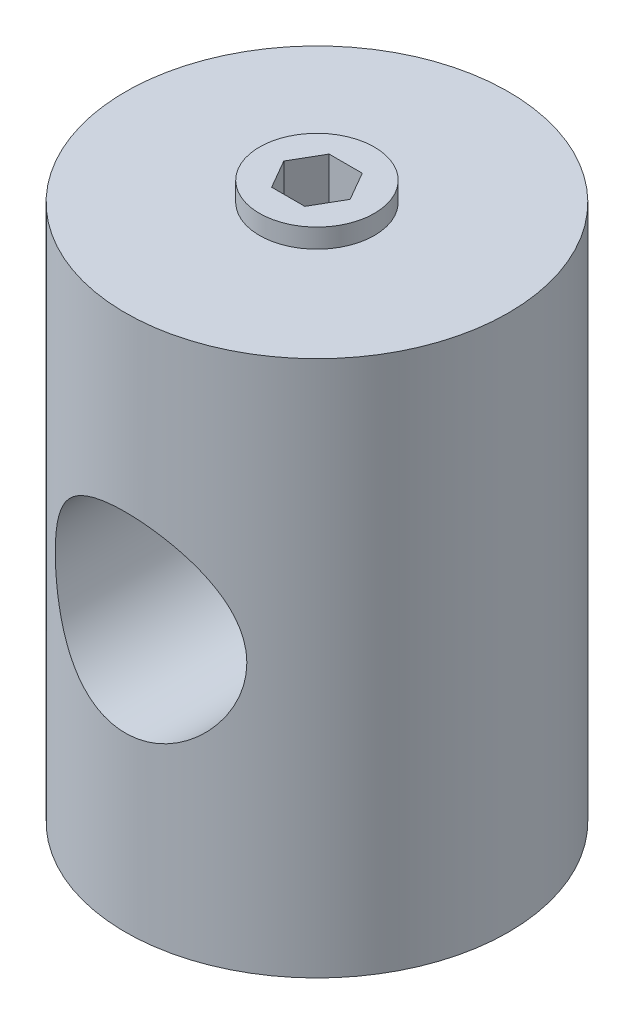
ISO-10303-21;
HEADER;
FILE_DESCRIPTION(('STEP AP214'),'2;1');
FILE_NAME('part.step','',(''),(''),'','','');
FILE_SCHEMA(('AUTOMOTIVE_DESIGN { 1 0 10303 214 1 1 1 1 }'));
ENDSEC;
DATA;
#1=APPLICATION_CONTEXT('core data for automotive mechanical design processes');
#2=APPLICATION_PROTOCOL_DEFINITION('international standard','automotive_design',2000,#1);
#3=PRODUCT_CONTEXT('',#1,'mechanical');
#4=PRODUCT('Part','Part','',(#3));
#5=PRODUCT_RELATED_PRODUCT_CATEGORY('part','',(#4));
#6=PRODUCT_DEFINITION_FORMATION('','',#4);
#7=PRODUCT_DEFINITION_CONTEXT('part definition',#1,'design');
#8=PRODUCT_DEFINITION('design','',#6,#7);
#9=PRODUCT_DEFINITION_SHAPE('','',#8);
#10=(LENGTH_UNIT() NAMED_UNIT(*) SI_UNIT(.MILLI.,.METRE.));
#11=(NAMED_UNIT(*) PLANE_ANGLE_UNIT() SI_UNIT($,.RADIAN.));
#12=(NAMED_UNIT(*) SI_UNIT($,.STERADIAN.) SOLID_ANGLE_UNIT());
#13=UNCERTAINTY_MEASURE_WITH_UNIT(LENGTH_MEASURE(1.E-05),#10,'distance_accuracy_value','');
#14=(GEOMETRIC_REPRESENTATION_CONTEXT(3) GLOBAL_UNCERTAINTY_ASSIGNED_CONTEXT((#13)) GLOBAL_UNIT_ASSIGNED_CONTEXT((#10,
#11,#12)) REPRESENTATION_CONTEXT('',''));
#15=CARTESIAN_POINT('',(0.,0.,0.));
#16=DIRECTION('',(0.,0.,1.));
#17=DIRECTION('',(1.,0.,0.));
#18=AXIS2_PLACEMENT_3D('',#15,#16,#17);
#19=CARTESIAN_POINT('',(-1.29903810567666,6.3,0.75));
#20=DIRECTION('',(0.,1.,0.));
#21=DIRECTION('',(-1.,0.,0.));
#22=AXIS2_PLACEMENT_3D('',#19,#20,#21);
#23=PLANE('',#22);
#24=DIRECTION('',(-0.5,0.,0.866025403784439));
#25=VECTOR('',#24,1.);
#26=CARTESIAN_POINT('',(-0.43301270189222,6.3,-0.75));
#27=LINE('',#26,#25);
#28=CARTESIAN_POINT('',(-0.43301270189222,6.3,-0.75));
#29=VERTEX_POINT('',#28);
#30=CARTESIAN_POINT('',(-0.86602540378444,6.3,0.));
#31=VERTEX_POINT('',#30);
#32=EDGE_CURVE('E169',#29,#31,#27,.T.);
#33=ORIENTED_EDGE('',*,*,#32,.T.);
#34=DIRECTION('',(0.5,0.,0.866025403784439));
#35=VECTOR('',#34,1.);
#36=CARTESIAN_POINT('',(-0.86602540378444,6.3,0.));
#37=LINE('',#36,#35);
#38=CARTESIAN_POINT('',(-0.43301270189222,6.3,0.75));
#39=VERTEX_POINT('',#38);
#40=EDGE_CURVE('E91',#31,#39,#37,.T.);
#41=ORIENTED_EDGE('',*,*,#40,.T.);
#42=DIRECTION('',(1.,0.,0.));
#43=VECTOR('',#42,1.);
#44=CARTESIAN_POINT('',(-0.43301270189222,6.3,0.75));
#45=LINE('',#44,#43);
#46=CARTESIAN_POINT('',(0.433012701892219,6.3,0.75));
#47=VERTEX_POINT('',#46);
#48=EDGE_CURVE('E165',#39,#47,#45,.T.);
#49=ORIENTED_EDGE('',*,*,#48,.T.);
#50=DIRECTION('',(0.5,0.,-0.866025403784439));
#51=VECTOR('',#50,1.);
#52=CARTESIAN_POINT('',(0.433012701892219,6.3,0.75));
#53=LINE('',#52,#51);
#54=CARTESIAN_POINT('',(0.866025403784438,6.3,0.));
#55=VERTEX_POINT('',#54);
#56=EDGE_CURVE('E162',#47,#55,#53,.T.);
#57=ORIENTED_EDGE('',*,*,#56,.T.);
#58=DIRECTION('',(-0.5,0.,-0.866025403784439));
#59=VECTOR('',#58,1.);
#60=CARTESIAN_POINT('',(0.866025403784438,6.3,0.));
#61=LINE('',#60,#59);
#62=CARTESIAN_POINT('',(0.43301270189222,6.3,-0.75));
#63=VERTEX_POINT('',#62);
#64=EDGE_CURVE('E159',#55,#63,#61,.T.);
#65=ORIENTED_EDGE('',*,*,#64,.T.);
#66=DIRECTION('',(-1.,0.,0.));
#67=VECTOR('',#66,1.);
#68=CARTESIAN_POINT('',(0.43301270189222,6.3,-0.75));
#69=LINE('',#68,#67);
#70=EDGE_CURVE('E93',#63,#29,#69,.T.);
#71=ORIENTED_EDGE('',*,*,#70,.T.);
#72=EDGE_LOOP('',(#33,#41,#49,#57,#65,#71));
#73=FACE_BOUND('',#72,.T.);
#74=ADVANCED_FACE('F14',(#73),#23,.T.);
#75=CARTESIAN_POINT('',(-0.43301270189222,6.3,0.75));
#76=DIRECTION('',(0.,0.,1.));
#77=DIRECTION('',(1.,0.,0.));
#78=AXIS2_PLACEMENT_3D('',#75,#76,#77);
#79=PLANE('',#78);
#80=DIRECTION('',(1.,0.,0.));
#81=VECTOR('',#80,1.);
#82=CARTESIAN_POINT('',(-0.43301270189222,7.5,0.75));
#83=LINE('',#82,#81);
#84=CARTESIAN_POINT('',(-0.43301270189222,7.5,0.75));
#85=VERTEX_POINT('',#84);
#86=CARTESIAN_POINT('',(0.433012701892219,7.5,0.75));
#87=VERTEX_POINT('',#86);
#88=EDGE_CURVE('E98',#85,#87,#83,.T.);
#89=ORIENTED_EDGE('',*,*,#88,.T.);
#90=DIRECTION('',(0.,1.,0.));
#91=VECTOR('',#90,1.);
#92=CARTESIAN_POINT('',(0.433012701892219,6.3,0.75));
#93=LINE('',#92,#91);
#94=EDGE_CURVE('E43',#47,#87,#93,.T.);
#95=ORIENTED_EDGE('',*,*,#94,.F.);
#96=ORIENTED_EDGE('',*,*,#48,.F.);
#97=DIRECTION('',(0.,1.,0.));
#98=VECTOR('',#97,1.);
#99=CARTESIAN_POINT('',(-0.43301270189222,6.3,0.75));
#100=LINE('',#99,#98);
#101=EDGE_CURVE('E35',#39,#85,#100,.T.);
#102=ORIENTED_EDGE('',*,*,#101,.T.);
#103=EDGE_LOOP('',(#89,#95,#96,#102));
#104=FACE_BOUND('',#103,.T.);
#105=ADVANCED_FACE('F182',(#104),#79,.F.);
#106=CARTESIAN_POINT('',(0.433012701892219,6.3,0.75));
#107=DIRECTION('',(0.866025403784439,0.,0.5));
#108=DIRECTION('',(0.5,0.,-0.866025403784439));
#109=AXIS2_PLACEMENT_3D('',#106,#107,#108);
#110=PLANE('',#109);
#111=DIRECTION('',(0.5,0.,-0.866025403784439));
#112=VECTOR('',#111,1.);
#113=CARTESIAN_POINT('',(0.433012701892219,7.5,0.75));
#114=LINE('',#113,#112);
#115=CARTESIAN_POINT('',(0.866025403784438,7.5,0.));
#116=VERTEX_POINT('',#115);
#117=EDGE_CURVE('E100',#87,#116,#114,.T.);
#118=ORIENTED_EDGE('',*,*,#117,.T.);
#119=DIRECTION('',(0.,1.,0.));
#120=VECTOR('',#119,1.);
#121=CARTESIAN_POINT('',(0.866025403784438,6.3,0.));
#122=LINE('',#121,#120);
#123=EDGE_CURVE('E152',#55,#116,#122,.T.);
#124=ORIENTED_EDGE('',*,*,#123,.F.);
#125=ORIENTED_EDGE('',*,*,#56,.F.);
#126=ORIENTED_EDGE('',*,*,#94,.T.);
#127=EDGE_LOOP('',(#118,#124,#125,#126));
#128=FACE_BOUND('',#127,.T.);
#129=ADVANCED_FACE('F176',(#128),#110,.F.);
#130=CARTESIAN_POINT('',(0.866025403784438,6.3,0.));
#131=DIRECTION('',(0.866025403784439,0.,-0.5));
#132=DIRECTION('',(-0.5,0.,-0.866025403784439));
#133=AXIS2_PLACEMENT_3D('',#130,#131,#132);
#134=PLANE('',#133);
#135=DIRECTION('',(-0.5,0.,-0.866025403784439));
#136=VECTOR('',#135,1.);
#137=CARTESIAN_POINT('',(0.866025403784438,7.5,0.));
#138=LINE('',#137,#136);
#139=CARTESIAN_POINT('',(0.43301270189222,7.5,-0.75));
#140=VERTEX_POINT('',#139);
#141=EDGE_CURVE('E173',#116,#140,#138,.T.);
#142=ORIENTED_EDGE('',*,*,#141,.T.);
#143=DIRECTION('',(0.,1.,0.));
#144=VECTOR('',#143,1.);
#145=CARTESIAN_POINT('',(0.43301270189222,6.3,-0.75));
#146=LINE('',#145,#144);
#147=EDGE_CURVE('E154',#63,#140,#146,.T.);
#148=ORIENTED_EDGE('',*,*,#147,.F.);
#149=ORIENTED_EDGE('',*,*,#64,.F.);
#150=ORIENTED_EDGE('',*,*,#123,.T.);
#151=EDGE_LOOP('',(#142,#148,#149,#150));
#152=FACE_BOUND('',#151,.T.);
#153=ADVANCED_FACE('F179',(#152),#134,.F.);
#154=CARTESIAN_POINT('',(0.43301270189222,6.3,-0.75));
#155=DIRECTION('',(0.,0.,-1.));
#156=DIRECTION('',(-1.,0.,0.));
#157=AXIS2_PLACEMENT_3D('',#154,#155,#156);
#158=PLANE('',#157);
#159=DIRECTION('',(-1.,0.,0.));
#160=VECTOR('',#159,1.);
#161=CARTESIAN_POINT('',(0.43301270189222,7.5,-0.75));
#162=LINE('',#161,#160);
#163=CARTESIAN_POINT('',(-0.43301270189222,7.5,-0.75));
#164=VERTEX_POINT('',#163);
#165=EDGE_CURVE('E171',#140,#164,#162,.T.);
#166=ORIENTED_EDGE('',*,*,#165,.T.);
#167=DIRECTION('',(0.,1.,0.));
#168=VECTOR('',#167,1.);
#169=CARTESIAN_POINT('',(-0.43301270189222,6.3,-0.75));
#170=LINE('',#169,#168);
#171=EDGE_CURVE('E79',#29,#164,#170,.T.);
#172=ORIENTED_EDGE('',*,*,#171,.F.);
#173=ORIENTED_EDGE('',*,*,#70,.F.);
#174=ORIENTED_EDGE('',*,*,#147,.T.);
#175=EDGE_LOOP('',(#166,#172,#173,#174));
#176=FACE_BOUND('',#175,.T.);
#177=ADVANCED_FACE('F273',(#176),#158,.F.);
#178=CARTESIAN_POINT('',(-0.43301270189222,6.3,-0.75));
#179=DIRECTION('',(-0.866025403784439,0.,-0.5));
#180=DIRECTION('',(-0.5,0.,0.866025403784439));
#181=AXIS2_PLACEMENT_3D('',#178,#179,#180);
#182=PLANE('',#181);
#183=DIRECTION('',(-0.5,0.,0.866025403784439));
#184=VECTOR('',#183,1.);
#185=CARTESIAN_POINT('',(-0.43301270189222,7.5,-0.75));
#186=LINE('',#185,#184);
#187=CARTESIAN_POINT('',(-0.866025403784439,7.5,0.));
#188=VERTEX_POINT('',#187);
#189=EDGE_CURVE('E73',#164,#188,#186,.T.);
#190=ORIENTED_EDGE('',*,*,#189,.T.);
#191=DIRECTION('',(0.,1.,0.));
#192=VECTOR('',#191,1.);
#193=CARTESIAN_POINT('',(-0.86602540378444,6.3,0.));
#194=LINE('',#193,#192);
#195=EDGE_CURVE('E77',#31,#188,#194,.T.);
#196=ORIENTED_EDGE('',*,*,#195,.F.);
#197=ORIENTED_EDGE('',*,*,#32,.F.);
#198=ORIENTED_EDGE('',*,*,#171,.T.);
#199=EDGE_LOOP('',(#190,#196,#197,#198));
#200=FACE_BOUND('',#199,.T.);
#201=ADVANCED_FACE('F75',(#200),#182,.F.);
#202=CARTESIAN_POINT('',(-0.86602540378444,6.3,0.));
#203=DIRECTION('',(-0.866025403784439,0.,0.5));
#204=DIRECTION('',(0.5,0.,0.866025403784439));
#205=AXIS2_PLACEMENT_3D('',#202,#203,#204);
#206=PLANE('',#205);
#207=DIRECTION('',(0.5,0.,0.866025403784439));
#208=VECTOR('',#207,1.);
#209=CARTESIAN_POINT('',(-0.866025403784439,7.5,0.));
#210=LINE('',#209,#208);
#211=EDGE_CURVE('E85',#188,#85,#210,.T.);
#212=ORIENTED_EDGE('',*,*,#211,.T.);
#213=ORIENTED_EDGE('',*,*,#101,.F.);
#214=ORIENTED_EDGE('',*,*,#40,.F.);
#215=ORIENTED_EDGE('',*,*,#195,.T.);
#216=EDGE_LOOP('',(#212,#213,#214,#215));
#217=FACE_BOUND('',#216,.T.);
#218=ADVANCED_FACE('F88',(#217),#206,.F.);
#219=CARTESIAN_POINT('',(0.,7.5,0.));
#220=DIRECTION('',(0.,-1.,0.));
#221=DIRECTION('',(1.,0.,0.));
#222=AXIS2_PLACEMENT_3D('',#219,#220,#221);
#223=PLANE('',#222);
#224=ORIENTED_EDGE('',*,*,#211,.F.);
#225=ORIENTED_EDGE('',*,*,#189,.F.);
#226=ORIENTED_EDGE('',*,*,#165,.F.);
#227=ORIENTED_EDGE('',*,*,#141,.F.);
#228=ORIENTED_EDGE('',*,*,#117,.F.);
#229=ORIENTED_EDGE('',*,*,#88,.F.);
#230=EDGE_LOOP('',(#224,#225,#226,#227,#228,#229));
#231=FACE_BOUND('',#230,.T.);
#232=CARTESIAN_POINT('',(0.,7.5,0.));
#233=DIRECTION('',(0.,-1.,0.));
#234=DIRECTION('',(1.,0.,0.));
#235=AXIS2_PLACEMENT_3D('',#232,#233,#234);
#236=CIRCLE('',#235,1.5);
#237=CARTESIAN_POINT('',(1.5,7.5,0.));
#238=VERTEX_POINT('',#237);
#239=EDGE_CURVE('E147',#238,#238,#236,.T.);
#240=ORIENTED_EDGE('',*,*,#239,.F.);
#241=EDGE_LOOP('',(#240));
#242=FACE_BOUND('',#241,.T.);
#243=ADVANCED_FACE('F95',(#231,#242),#223,.F.);
#244=CARTESIAN_POINT('',(0.,4.5,0.));
#245=DIRECTION('',(0.,-1.,0.));
#246=DIRECTION('',(1.,0.,0.));
#247=AXIS2_PLACEMENT_3D('',#244,#245,#246);
#248=CYLINDRICAL_SURFACE('',#247,1.5);
#249=ORIENTED_EDGE('',*,*,#239,.T.);
#250=EDGE_LOOP('',(#249));
#251=FACE_BOUND('',#250,.T.);
#252=CARTESIAN_POINT('',(0.,7.,0.));
#253=DIRECTION('',(0.,-1.,0.));
#254=DIRECTION('',(1.,0.,0.));
#255=AXIS2_PLACEMENT_3D('',#252,#253,#254);
#256=CIRCLE('',#255,1.5);
#257=CARTESIAN_POINT('',(1.5,7.,0.));
#258=VERTEX_POINT('',#257);
#259=EDGE_CURVE('E144',#258,#258,#256,.T.);
#260=ORIENTED_EDGE('',*,*,#259,.F.);
#261=EDGE_LOOP('',(#260));
#262=FACE_BOUND('',#261,.T.);
#263=ADVANCED_FACE('F131',(#251,#262),#248,.T.);
#264=CARTESIAN_POINT('',(0.,-7.,0.));
#265=DIRECTION('',(0.,-1.,0.));
#266=DIRECTION('',(1.,0.,0.));
#267=AXIS2_PLACEMENT_3D('',#264,#265,#266);
#268=PLANE('',#267);
#269=CARTESIAN_POINT('',(0.,-7.,0.));
#270=DIRECTION('',(0.,-1.,0.));
#271=DIRECTION('',(1.,0.,0.));
#272=AXIS2_PLACEMENT_3D('',#269,#270,#271);
#273=CIRCLE('',#272,5.);
#274=CARTESIAN_POINT('',(5.,-7.,0.));
#275=VERTEX_POINT('',#274);
#276=EDGE_CURVE('E111',#275,#275,#273,.T.);
#277=ORIENTED_EDGE('',*,*,#276,.T.);
#278=EDGE_LOOP('',(#277));
#279=FACE_BOUND('',#278,.T.);
#280=ADVANCED_FACE('F194',(#279),#268,.T.);
#281=CARTESIAN_POINT('',(0.,-7.,0.));
#282=DIRECTION('',(0.,1.,0.));
#283=DIRECTION('',(-1.,0.,0.));
#284=AXIS2_PLACEMENT_3D('',#281,#282,#283);
#285=CYLINDRICAL_SURFACE('',#284,5.);
#286=CARTESIAN_POINT('',(2.5,0.,4.3301270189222));
#287=CARTESIAN_POINT('',(2.49998948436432,-0.130266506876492,4.33013982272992));
#288=CARTESIAN_POINT('',(2.48974954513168,-0.260702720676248,4.33609541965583));
#289=CARTESIAN_POINT('',(2.44930840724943,-0.517568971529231,4.35905877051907));
#290=CARTESIAN_POINT('',(2.41906526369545,-0.643990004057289,4.37608974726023));
#291=CARTESIAN_POINT('',(2.3402497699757,-0.888628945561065,4.41873376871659));
#292=CARTESIAN_POINT('',(2.29177485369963,-1.00688657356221,4.44430111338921));
#293=CARTESIAN_POINT('',(2.17816884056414,-1.23356056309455,4.50106659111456));
#294=CARTESIAN_POINT('',(2.11303684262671,-1.34197639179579,4.53226502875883));
#295=CARTESIAN_POINT('',(1.96166634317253,-1.55576430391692,4.59992173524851));
#296=CARTESIAN_POINT('',(1.87413008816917,-1.66014783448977,4.63660159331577));
#297=CARTESIAN_POINT('',(1.68313452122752,-1.8535209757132,4.70929956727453));
#298=CARTESIAN_POINT('',(1.57966731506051,-1.94250290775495,4.74531734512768));
#299=CARTESIAN_POINT('',(1.35122390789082,-2.10841787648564,4.81553692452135));
#300=CARTESIAN_POINT('',(1.22526797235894,-2.18413441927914,4.84945266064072));
#301=CARTESIAN_POINT('',(0.960392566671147,-2.31285213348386,4.90876890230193));
#302=CARTESIAN_POINT('',(0.821481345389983,-2.3658676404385,4.93417477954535));
#303=CARTESIAN_POINT('',(0.545112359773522,-2.44376165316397,4.9720115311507));
#304=CARTESIAN_POINT('',(0.408254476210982,-2.47037381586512,4.98523700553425));
#305=CARTESIAN_POINT('',(0.131426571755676,-2.50041529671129,5.00018959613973));
#306=CARTESIAN_POINT('',(-0.008541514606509,-2.50385864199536,5.00192366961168));
#307=CARTESIAN_POINT('',(-0.274581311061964,-2.48813331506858,4.99407454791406));
#308=CARTESIAN_POINT('',(-0.400802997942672,-2.47090496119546,4.98546239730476));
#309=CARTESIAN_POINT('',(-0.648284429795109,-2.41779789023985,4.95935613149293));
#310=CARTESIAN_POINT('',(-0.769543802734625,-2.38191777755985,4.94186135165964));
#311=CARTESIAN_POINT('',(-1.00577347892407,-2.29229358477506,4.89928958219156));
#312=CARTESIAN_POINT('',(-1.120633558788,-2.23830921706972,4.87411103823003));
#313=CARTESIAN_POINT('',(-1.33994200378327,-2.11434145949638,4.81844114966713));
#314=CARTESIAN_POINT('',(-1.4443866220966,-2.04435234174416,4.78794790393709));
#315=CARTESIAN_POINT('',(-1.6504341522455,-1.88276162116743,4.72110985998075));
#316=CARTESIAN_POINT('',(-1.7508351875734,-1.78974242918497,4.68448439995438));
#317=CARTESIAN_POINT('',(-1.93526092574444,-1.58852568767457,4.61135851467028));
#318=CARTESIAN_POINT('',(-2.01927302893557,-1.48031656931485,4.57485820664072));
#319=CARTESIAN_POINT('',(-2.17376333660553,-1.24337951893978,4.50360390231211));
#320=CARTESIAN_POINT('',(-2.24304328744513,-1.11378494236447,4.46910799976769));
#321=CARTESIAN_POINT('',(-2.35829778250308,-0.842655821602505,4.4093862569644));
#322=CARTESIAN_POINT('',(-2.40429664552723,-0.701133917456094,4.38415075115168));
#323=CARTESIAN_POINT('',(-2.4679505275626,-0.421963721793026,4.34861589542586));
#324=CARTESIAN_POINT('',(-2.48756280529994,-0.284897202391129,4.33729139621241));
#325=CARTESIAN_POINT('',(-2.50379236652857,-0.00899664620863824,4.32794798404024));
#326=CARTESIAN_POINT('',(-2.50042589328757,0.129836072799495,4.32991967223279));
#327=CARTESIAN_POINT('',(-2.47259010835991,0.389134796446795,4.34585841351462));
#328=CARTESIAN_POINT('',(-2.45046954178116,0.509948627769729,4.35848968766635));
#329=CARTESIAN_POINT('',(-2.38924071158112,0.745919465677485,4.39235053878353));
#330=CARTESIAN_POINT('',(-2.35012694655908,0.861074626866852,4.41358290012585));
#331=CARTESIAN_POINT('',(-2.25411897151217,1.08852832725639,4.46340555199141));
#332=CARTESIAN_POINT('',(-2.19648515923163,1.20044754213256,4.49229108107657));
#333=CARTESIAN_POINT('',(-2.0657176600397,1.4136731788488,4.55390298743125));
#334=CARTESIAN_POINT('',(-1.99257601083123,1.51497410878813,4.58663133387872));
#335=CARTESIAN_POINT('',(-1.82209291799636,1.71744691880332,4.65719996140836));
#336=CARTESIAN_POINT('',(-1.72286318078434,1.81699287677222,4.69516457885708));
#337=CARTESIAN_POINT('',(-1.50851123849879,1.99853059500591,4.76835587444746));
#338=CARTESIAN_POINT('',(-1.39338368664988,2.08051642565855,4.8035816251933));
#339=CARTESIAN_POINT('',(-1.14633840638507,2.22643431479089,4.86853404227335));
#340=CARTESIAN_POINT('',(-1.01405774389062,2.28983279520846,4.89809104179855));
#341=CARTESIAN_POINT('',(-0.738805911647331,2.39284475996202,4.9470838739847));
#342=CARTESIAN_POINT('',(-0.595844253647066,2.43247912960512,4.96652859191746));
#343=CARTESIAN_POINT('',(-0.317449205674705,2.48342140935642,4.99168770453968));
#344=CARTESIAN_POINT('',(-0.182528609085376,2.49699468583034,4.99849819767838));
#345=CARTESIAN_POINT('',(0.0878149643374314,2.50210816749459,5.00105325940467));
#346=CARTESIAN_POINT('',(0.223237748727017,2.49365608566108,4.99680170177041));
#347=CARTESIAN_POINT('',(0.481344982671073,2.45645896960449,4.97834922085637));
#348=CARTESIAN_POINT('',(0.604280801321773,2.42908782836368,4.96482236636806));
#349=CARTESIAN_POINT('',(0.843614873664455,2.35668255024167,4.92980234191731));
#350=CARTESIAN_POINT('',(0.960012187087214,2.31164588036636,4.90830802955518));
#351=CARTESIAN_POINT('',(1.18855854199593,2.20318218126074,4.85814826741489));
#352=CARTESIAN_POINT('',(1.30031295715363,2.13905097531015,4.82921542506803));
#353=CARTESIAN_POINT('',(1.51193650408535,1.99510588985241,4.76720333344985));
#354=CARTESIAN_POINT('',(1.61180014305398,1.91528480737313,4.73412218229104));
#355=CARTESIAN_POINT('',(1.8072854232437,1.73300420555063,4.66321523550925));
#356=CARTESIAN_POINT('',(1.90149582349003,1.62908227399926,4.62524489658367));
#357=CARTESIAN_POINT('',(2.07165660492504,1.40638471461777,4.55157698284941));
#358=CARTESIAN_POINT('',(2.1475908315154,1.28759608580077,4.51588143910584));
#359=CARTESIAN_POINT('',(2.28108393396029,1.03336388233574,4.44998982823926));
#360=CARTESIAN_POINT('',(2.3379862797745,0.897512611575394,4.42000320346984));
#361=CARTESIAN_POINT('',(2.40494911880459,0.686777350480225,4.38370272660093));
#362=CARTESIAN_POINT('',(2.42419582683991,0.615440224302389,4.37305486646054));
#363=CARTESIAN_POINT('',(2.45635087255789,0.470959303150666,4.35507574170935));
#364=CARTESIAN_POINT('',(2.46926364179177,0.397816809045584,4.34774215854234));
#365=CARTESIAN_POINT('',(2.48591166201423,0.27049901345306,4.33823779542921));
#366=CARTESIAN_POINT('',(2.49118864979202,0.216583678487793,4.33520487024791));
#367=CARTESIAN_POINT('',(2.49823512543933,0.108455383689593,4.33114674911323));
#368=CARTESIAN_POINT('',(2.50000437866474,0.0542424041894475,4.33012168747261));
#369=CARTESIAN_POINT('',(2.5,0.,4.3301270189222));
#370=B_SPLINE_CURVE_WITH_KNOTS('',3,(#286,#287,#288,#289,#290,#291,#292,#293,#294,#295,#296,
#297,#298,#299,#300,#301,#302,#303,#304,#305,#306,#307,#308,#309,#310,#311,#312,#313,#314,#315,
#316,#317,#318,#319,#320,#321,#322,#323,#324,#325,#326,#327,#328,#329,#330,#331,#332,#333,#334,
#335,#336,#337,#338,#339,#340,#341,#342,#343,#344,#345,#346,#347,#348,#349,#350,#351,#352,#353,
#354,#355,#356,#357,#358,#359,#360,#361,#362,#363,#364,#365,#366,#367,#368,#369),.UNSPECIFIED.,
.T.,.F.,(4,2,2,2,2,2,2,2,2,2,2,2,2,2,2,2,2,2,2,2,2,2,2,2,2,2,2,2,2,2,2,2,2,2,2,2,2,2,2,2,2,4),
(0.,0.390580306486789,0.781982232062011,1.17132148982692,1.56068181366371,1.98215578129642,
2.40383927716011,2.85394730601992,3.30377067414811,3.72158712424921,4.13915059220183,
4.52040243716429,4.90168281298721,5.2882383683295,5.67493248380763,6.0981797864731,
6.5217512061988,6.97222104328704,7.42221935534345,7.83655727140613,8.25060232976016,
8.61935458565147,8.98822631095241,9.37418241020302,9.76033715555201,10.1951685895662,
10.6301466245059,11.076604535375,11.5226694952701,11.927806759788,12.3328021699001,
12.7111106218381,13.0894733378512,13.4840187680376,13.8787457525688,14.3127560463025,
14.7471485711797,15.195268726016,15.4189244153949,15.6424233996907,15.8050484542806,
15.9676843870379),.UNSPECIFIED.);
#371=CARTESIAN_POINT('',(2.5,0.,4.3301270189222));
#372=VERTEX_POINT('',#371);
#373=EDGE_CURVE('E28',#372,#372,#370,.T.);
#374=ORIENTED_EDGE('',*,*,#373,.T.);
#375=EDGE_LOOP('',(#374));
#376=FACE_BOUND('',#375,.T.);
#377=CARTESIAN_POINT('',(0.,2.5,-5.));
#378=CARTESIAN_POINT('',(-0.131426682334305,2.49999033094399,-4.99999177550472));
#379=CARTESIAN_POINT('',(-0.263015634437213,2.48957443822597,-4.99476199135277));
#380=CARTESIAN_POINT('',(-0.522301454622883,2.44836817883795,-4.9743541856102));
#381=CARTESIAN_POINT('',(-0.649990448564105,2.41753911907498,-4.9591572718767));
#382=CARTESIAN_POINT('',(-0.897333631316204,2.33701537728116,-4.92040690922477));
#383=CARTESIAN_POINT('',(-1.01701694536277,2.28739401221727,-4.89688595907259));
#384=CARTESIAN_POINT('',(-1.24618160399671,2.1710734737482,-4.84364443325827));
#385=CARTESIAN_POINT('',(-1.3556637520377,2.10437564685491,-4.81392434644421));
#386=CARTESIAN_POINT('',(-1.56876952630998,1.95120686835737,-4.74890645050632));
#387=CARTESIAN_POINT('',(-1.67163802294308,1.86378379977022,-4.71337997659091));
#388=CARTESIAN_POINT('',(-1.86194861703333,1.67369630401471,-4.64149925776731));
#389=CARTESIAN_POINT('',(-1.94937895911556,1.57102037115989,-4.60514440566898));
#390=CARTESIAN_POINT('',(-2.11312999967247,1.34379162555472,-4.53247377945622));
#391=CARTESIAN_POINT('',(-2.18806333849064,1.21815975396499,-4.49637967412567));
#392=CARTESIAN_POINT('',(-2.31542056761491,0.954081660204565,-4.43214946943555));
#393=CARTESIAN_POINT('',(-2.36786053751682,0.815644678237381,-4.40400769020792));
#394=CARTESIAN_POINT('',(-2.44533110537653,0.538337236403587,-4.36144667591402));
#395=CARTESIAN_POINT('',(-2.47181464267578,0.399988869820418,-4.34630678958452));
#396=CARTESIAN_POINT('',(-2.50106748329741,0.120052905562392,-4.3295472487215));
#397=CARTESIAN_POINT('',(-2.50386022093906,-0.0215313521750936,-4.3279142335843));
#398=CARTESIAN_POINT('',(-2.48671821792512,-0.285715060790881,-4.33777325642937));
#399=CARTESIAN_POINT('',(-2.46946139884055,-0.408560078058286,-4.34771909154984));
#400=CARTESIAN_POINT('',(-2.41734962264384,-0.649304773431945,-4.37690571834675));
#401=CARTESIAN_POINT('',(-2.38248905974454,-0.767202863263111,-4.39614947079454));
#402=CARTESIAN_POINT('',(-2.29552445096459,-0.998072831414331,-4.44218691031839));
#403=CARTESIAN_POINT('',(-2.24303766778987,-1.11086599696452,-4.46914601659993));
#404=CARTESIAN_POINT('',(-2.12260421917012,-1.32658573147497,-4.52758510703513));
#405=CARTESIAN_POINT('',(-2.0546506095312,-1.42950783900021,-4.55906711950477));
#406=CARTESIAN_POINT('',(-1.89516513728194,-1.63630313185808,-4.62782894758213));
#407=CARTESIAN_POINT('',(-1.8017361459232,-1.7386421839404,-4.66533775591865));
#408=CARTESIAN_POINT('',(-1.59888894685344,-1.92683854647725,-4.73869058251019));
#409=CARTESIAN_POINT('',(-1.48946314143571,-2.01268798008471,-4.77453379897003));
#410=CARTESIAN_POINT('',(-1.25129126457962,-2.16921415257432,-4.84254968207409));
#411=CARTESIAN_POINT('',(-1.12188397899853,-2.23900118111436,-4.87447460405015));
#412=CARTESIAN_POINT('',(-0.851165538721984,-2.35524257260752,-4.92894702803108));
#413=CARTESIAN_POINT('',(-0.709863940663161,-2.4017154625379,-4.95150197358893));
#414=CARTESIAN_POINT('',(-0.43191622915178,-2.46618850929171,-4.98310834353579));
#415=CARTESIAN_POINT('',(-0.295853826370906,-2.486228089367,-4.9931234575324));
#416=CARTESIAN_POINT('',(-0.0219489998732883,-2.50366182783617,-5.00182533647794));
#417=CARTESIAN_POINT('',(0.115892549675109,-2.50106671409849,-5.00051746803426));
#418=CARTESIAN_POINT('',(0.378082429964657,-2.4744832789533,-4.98727980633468));
#419=CARTESIAN_POINT('',(0.502648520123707,-2.45216866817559,-4.97618114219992));
#420=CARTESIAN_POINT('',(0.746017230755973,-2.38940482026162,-4.94555428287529));
#421=CARTESIAN_POINT('',(0.864819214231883,-2.34895358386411,-4.92602515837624));
#422=CARTESIAN_POINT('',(1.09722152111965,-2.25000383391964,-4.87960628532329));
#423=CARTESIAN_POINT('',(1.21057599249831,-2.19102237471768,-4.85252204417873));
#424=CARTESIAN_POINT('',(1.42615340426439,-2.05723116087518,-4.7935993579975));
#425=CARTESIAN_POINT('',(1.52837157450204,-1.98241466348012,-4.76175888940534));
#426=CARTESIAN_POINT('',(1.72941922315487,-1.81059893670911,-4.69270553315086));
#427=CARTESIAN_POINT('',(1.82693019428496,-1.7121428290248,-4.65527212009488));
#428=CARTESIAN_POINT('',(2.0046408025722,-1.50018712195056,-4.58155978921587));
#429=CARTESIAN_POINT('',(2.08482846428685,-1.38667720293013,-4.54528168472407));
#430=CARTESIAN_POINT('',(2.22926978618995,-1.14089086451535,-4.4762798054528));
#431=CARTESIAN_POINT('',(2.29256373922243,-1.00797183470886,-4.44381323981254));
#432=CARTESIAN_POINT('',(2.39520706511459,-0.731224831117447,-4.38935180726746));
#433=CARTESIAN_POINT('',(2.43458729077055,-0.587411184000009,-4.36734345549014));
#434=CARTESIAN_POINT('',(2.48465421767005,-0.307724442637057,-4.33903752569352));
#435=CARTESIAN_POINT('',(2.4977324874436,-0.17241436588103,-4.33143458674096));
#436=CARTESIAN_POINT('',(2.50172288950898,0.0986176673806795,-4.32913386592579));
#437=CARTESIAN_POINT('',(2.49264462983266,0.234339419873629,-4.33443049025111));
#438=CARTESIAN_POINT('',(2.45481530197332,0.48870875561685,-4.35594655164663));
#439=CARTESIAN_POINT('',(2.42802074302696,0.607751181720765,-4.37107736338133));
#440=CARTESIAN_POINT('',(2.35793843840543,0.839520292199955,-4.40927540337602));
#441=CARTESIAN_POINT('',(2.31464538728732,0.952244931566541,-4.43234518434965));
#442=CARTESIAN_POINT('',(2.20953919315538,1.17656215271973,-4.48571326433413));
#443=CARTESIAN_POINT('',(2.14667719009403,1.28756985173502,-4.5163930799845));
#444=CARTESIAN_POINT('',(2.0053780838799,1.49818624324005,-4.58088327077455));
#445=CARTESIAN_POINT('',(1.92693287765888,1.59778896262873,-4.61469526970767));
#446=CARTESIAN_POINT('',(1.74550556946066,1.79535536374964,-4.68655816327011));
#447=CARTESIAN_POINT('',(1.6407002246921,1.89164936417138,-4.72462491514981));
#448=CARTESIAN_POINT('',(1.41539785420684,2.06565584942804,-4.79694347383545));
#449=CARTESIAN_POINT('',(1.29489242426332,2.14335831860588,-4.83119321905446));
#450=CARTESIAN_POINT('',(1.03978808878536,2.2780969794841,-4.89245149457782));
#451=CARTESIAN_POINT('',(0.905095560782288,2.33498316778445,-4.91940711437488));
#452=CARTESIAN_POINT('',(0.696328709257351,2.4021838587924,-4.9517796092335));
#453=CARTESIAN_POINT('',(0.625670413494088,2.42155539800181,-4.96122314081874));
#454=CARTESIAN_POINT('',(0.482623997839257,2.4540659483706,-4.97717127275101));
#455=CARTESIAN_POINT('',(0.410236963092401,2.46720876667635,-4.98367766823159));
#456=CARTESIAN_POINT('',(0.28151868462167,2.48473747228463,-4.9923820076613));
#457=CARTESIAN_POINT('',(0.225408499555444,2.49045493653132,-4.99523288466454));
#458=CARTESIAN_POINT('',(0.112875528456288,2.49808832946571,-4.99904367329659));
#459=CARTESIAN_POINT('',(0.0564527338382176,2.50000415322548,-5.00000353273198));
#460=CARTESIAN_POINT('',(0.,2.5,-5.));
#461=B_SPLINE_CURVE_WITH_KNOTS('',3,(#377,#378,#379,#380,#381,#382,#383,#384,#385,#386,#387,
#388,#389,#390,#391,#392,#393,#394,#395,#396,#397,#398,#399,#400,#401,#402,#403,#404,#405,#406,
#407,#408,#409,#410,#411,#412,#413,#414,#415,#416,#417,#418,#419,#420,#421,#422,#423,#424,#425,
#426,#427,#428,#429,#430,#431,#432,#433,#434,#435,#436,#437,#438,#439,#440,#441,#442,#443,#444,
#445,#446,#447,#448,#449,#450,#451,#452,#453,#454,#455,#456,#457,#458,#459,#460),.UNSPECIFIED.,
.T.,.F.,(4,2,2,2,2,2,2,2,2,2,2,2,2,2,2,2,2,2,2,2,2,2,2,2,2,2,2,2,2,2,2,2,2,2,2,2,2,2,2,2,2,4),
(0.,0.394060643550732,0.788870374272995,1.18215538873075,1.57540940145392,1.99245439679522,
2.40981559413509,2.85954316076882,3.30894869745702,3.73145030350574,4.15353393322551,
4.52514281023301,4.89687009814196,5.27725600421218,5.65781303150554,6.08662353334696,
6.51563836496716,6.96457555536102,7.41315542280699,7.82458226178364,8.2358141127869,
8.61517266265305,8.99457304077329,9.38482140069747,9.77523626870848,10.2039902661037,
10.6330397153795,11.0828670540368,11.53211279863,11.9382326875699,12.3441764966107,
12.7114482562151,13.0788382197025,13.4709114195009,13.8631890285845,14.303131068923,
14.7433095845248,15.1866003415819,15.407934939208,15.6291340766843,15.7983933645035,
15.9676573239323),.UNSPECIFIED.);
#462=CARTESIAN_POINT('',(0.,2.5,-5.));
#463=VERTEX_POINT('',#462);
#464=EDGE_CURVE('E9',#463,#463,#461,.T.);
#465=ORIENTED_EDGE('',*,*,#464,.T.);
#466=EDGE_LOOP('',(#465));
#467=FACE_BOUND('',#466,.T.);
#468=ORIENTED_EDGE('',*,*,#276,.F.);
#469=EDGE_LOOP('',(#468));
#470=FACE_BOUND('',#469,.T.);
#471=CARTESIAN_POINT('',(0.,7.,0.));
#472=DIRECTION('',(0.,-1.,0.));
#473=DIRECTION('',(1.,0.,0.));
#474=AXIS2_PLACEMENT_3D('',#471,#472,#473);
#475=CIRCLE('',#474,5.);
#476=CARTESIAN_POINT('',(5.,7.,0.));
#477=VERTEX_POINT('',#476);
#478=EDGE_CURVE('E114',#477,#477,#475,.T.);
#479=ORIENTED_EDGE('',*,*,#478,.T.);
#480=EDGE_LOOP('',(#479));
#481=FACE_BOUND('',#480,.T.);
#482=ADVANCED_FACE('F120',(#376,#467,#470,#481),#285,.T.);
#483=CARTESIAN_POINT('',(0.,7.,0.));
#484=DIRECTION('',(0.,-1.,0.));
#485=DIRECTION('',(1.,0.,0.));
#486=AXIS2_PLACEMENT_3D('',#483,#484,#485);
#487=PLANE('',#486);
#488=ORIENTED_EDGE('',*,*,#478,.F.);
#489=EDGE_LOOP('',(#488));
#490=FACE_BOUND('',#489,.T.);
#491=ORIENTED_EDGE('',*,*,#259,.T.);
#492=EDGE_LOOP('',(#491));
#493=FACE_BOUND('',#492,.T.);
#494=ADVANCED_FACE('F129',(#490,#493),#487,.F.);
#495=CARTESIAN_POINT('',(0.,0.,-5.));
#496=DIRECTION('',(0.,0.,1.));
#497=DIRECTION('',(1.,0.,0.));
#498=AXIS2_PLACEMENT_3D('',#495,#496,#497);
#499=CYLINDRICAL_SURFACE('',#498,2.5);
#500=ORIENTED_EDGE('',*,*,#464,.F.);
#501=EDGE_LOOP('',(#500));
#502=FACE_BOUND('',#501,.T.);
#503=ORIENTED_EDGE('',*,*,#373,.F.);
#504=EDGE_LOOP('',(#503));
#505=FACE_BOUND('',#504,.T.);
#506=CARTESIAN_POINT('',(-1.25,2.1650635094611,0.));
#507=CARTESIAN_POINT('',(-1.24999545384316,2.16506918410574,-0.0651347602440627));
#508=CARTESIAN_POINT('',(-1.24487496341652,2.16804751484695,-0.130351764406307));
#509=CARTESIAN_POINT('',(-1.22465401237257,2.17952958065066,-0.258784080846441));
#510=CARTESIAN_POINT('',(-1.20953258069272,2.18804492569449,-0.32199489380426));
#511=CARTESIAN_POINT('',(-1.17012493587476,2.20936683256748,-0.444314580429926));
#512=CARTESIAN_POINT('',(-1.14588744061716,2.22215054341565,-0.503443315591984));
#513=CARTESIAN_POINT('',(-1.08908440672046,2.25053331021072,-0.6167802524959));
#514=CARTESIAN_POINT('',(-1.05651841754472,2.26613251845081,-0.670988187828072));
#515=CARTESIAN_POINT('',(-0.980833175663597,2.29996086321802,-0.777882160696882));
#516=CARTESIAN_POINT('',(-0.937065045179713,2.31830079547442,-0.83007391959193));
#517=CARTESIAN_POINT('',(-0.841567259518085,2.35464978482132,-0.926760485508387));
#518=CARTESIAN_POINT('',(-0.789833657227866,2.37265867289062,-0.9712514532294));
#519=CARTESIAN_POINT('',(-0.675611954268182,2.40776846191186,-1.05420893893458));
#520=CARTESIAN_POINT('',(-0.612633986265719,2.42472633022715,-1.09206720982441));
#521=CARTESIAN_POINT('',(-0.480196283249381,2.45438445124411,-1.1564260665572));
#522=CARTESIAN_POINT('',(-0.410740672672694,2.46708738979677,-1.18293382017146));
#523=CARTESIAN_POINT('',(-0.272556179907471,2.48600576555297,-1.22188082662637));
#524=CARTESIAN_POINT('',(-0.204127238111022,2.49261850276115,-1.23518690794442));
#525=CARTESIAN_POINT('',(-0.0657132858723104,2.50009479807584,-1.2502076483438));
#526=CARTESIAN_POINT('',(0.00427075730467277,2.50096183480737,-1.25192932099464));
#527=CARTESIAN_POINT('',(0.137290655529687,2.49703727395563,-1.24406665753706));
#528=CARTESIAN_POINT('',(0.200401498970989,2.49273119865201,-1.23545248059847));
#529=CARTESIAN_POINT('',(0.324142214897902,2.47967806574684,-1.20889894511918));
#530=CARTESIAN_POINT('',(0.384771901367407,2.47093067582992,-1.19095888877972));
#531=CARTESIAN_POINT('',(0.502886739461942,2.44964479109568,-1.14614679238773));
#532=CARTESIAN_POINT('',(0.560316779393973,2.43705551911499,-1.11915460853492));
#533=CARTESIAN_POINT('',(0.669971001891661,2.40922057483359,-1.05717072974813));
#534=CARTESIAN_POINT('',(0.722193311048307,2.39397395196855,-1.02217617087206));
#535=CARTESIAN_POINT('',(0.825217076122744,2.36055492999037,-0.941380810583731));
#536=CARTESIAN_POINT('',(0.875417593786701,2.34224219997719,-0.894871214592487));
#537=CARTESIAN_POINT('',(0.967630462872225,2.30567925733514,-0.79426284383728));
#538=CARTESIAN_POINT('',(1.00963651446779,2.28742910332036,-0.740158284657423));
#539=CARTESIAN_POINT('',(1.08688166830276,2.25180195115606,-0.621689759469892));
#540=CARTESIAN_POINT('',(1.12152164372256,2.23455399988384,-0.556892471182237));
#541=CARTESIAN_POINT('',(1.17914889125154,2.2046931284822,-0.421327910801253));
#542=CARTESIAN_POINT('',(1.20214832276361,2.19207537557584,-0.350566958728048));
#543=CARTESIAN_POINT('',(1.2339752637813,2.17430794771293,-0.210981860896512));
#544=CARTESIAN_POINT('',(1.24378140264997,2.1686456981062,-0.142448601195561));
#545=CARTESIAN_POINT('',(1.25189618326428,2.16397399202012,-0.00449832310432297));
#546=CARTESIAN_POINT('',(1.25021294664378,2.16495983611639,0.0649180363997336));
#547=CARTESIAN_POINT('',(1.23629505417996,2.17292920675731,0.19456739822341));
#548=CARTESIAN_POINT('',(1.22523477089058,2.17924484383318,0.254974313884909));
#549=CARTESIAN_POINT('',(1.19462035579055,2.19617526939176,0.372959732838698));
#550=CARTESIAN_POINT('',(1.17506347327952,2.20679145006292,0.430537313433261));
#551=CARTESIAN_POINT('',(1.12705948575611,2.23170277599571,0.54426416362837));
#552=CARTESIAN_POINT('',(1.0982425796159,2.24614554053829,0.600223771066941));
#553=CARTESIAN_POINT('',(1.03285883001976,2.27695149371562,0.706836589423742));
#554=CARTESIAN_POINT('',(0.99628800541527,2.29331566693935,0.757487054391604));
#555=CARTESIAN_POINT('',(0.911046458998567,2.3285999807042,0.858723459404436));
#556=CARTESIAN_POINT('',(0.861431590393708,2.34758228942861,0.908496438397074));
#557=CARTESIAN_POINT('',(0.754255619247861,2.38417793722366,0.999265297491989));
#558=CARTESIAN_POINT('',(0.696691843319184,2.40179081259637,1.04025821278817));
#559=CARTESIAN_POINT('',(0.573169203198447,2.43426702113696,1.11321715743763));
#560=CARTESIAN_POINT('',(0.507028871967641,2.44904552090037,1.14491639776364));
#561=CARTESIAN_POINT('',(0.369402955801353,2.47354193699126,1.19642237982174));
#562=CARTESIAN_POINT('',(0.29792212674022,2.48326429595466,1.21623956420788));
#563=CARTESIAN_POINT('',(0.158724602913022,2.49584385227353,1.24171070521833));
#564=CARTESIAN_POINT('',(0.0912643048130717,2.49924909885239,1.24849734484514));
#565=CARTESIAN_POINT('',(-0.0439074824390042,2.50052662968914,1.251054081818));
#566=CARTESIAN_POINT('',(-0.111618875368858,2.49840085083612,1.24682803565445));
#567=CARTESIAN_POINT('',(-0.240672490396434,2.48917461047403,1.22822949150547));
#568=CARTESIAN_POINT('',(-0.30214039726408,2.48241118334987,1.21454393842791));
#569=CARTESIAN_POINT('',(-0.421807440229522,2.46490117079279,1.17834125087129));
#570=CARTESIAN_POINT('',(-0.480006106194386,2.45415401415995,1.15582284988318));
#571=CARTESIAN_POINT('',(-0.594279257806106,2.4290741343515,1.10159118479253));
#572=CARTESIAN_POINT('',(-0.650156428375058,2.41460771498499,1.0695258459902));
#573=CARTESIAN_POINT('',(-0.75596830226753,2.38360166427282,0.997552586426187));
#574=CARTESIAN_POINT('',(-0.805900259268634,2.36706108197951,0.957641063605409));
#575=CARTESIAN_POINT('',(-0.903642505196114,2.33160762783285,0.866503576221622));
#576=CARTESIAN_POINT('',(-0.95074710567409,2.31262248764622,0.81454689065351));
#577=CARTESIAN_POINT('',(-1.03582910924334,2.27578845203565,0.703186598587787));
#578=CARTESIAN_POINT('',(-1.07379843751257,2.25794057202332,0.643776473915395));
#579=CARTESIAN_POINT('',(-1.14053884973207,2.22499506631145,0.516704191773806));
#580=CARTESIAN_POINT('',(-1.16898133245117,2.21000217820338,0.44884058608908));
#581=CARTESIAN_POINT('',(-1.21359838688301,2.1858269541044,0.308334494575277));
#582=CARTESIAN_POINT('',(-1.22981398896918,2.17662520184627,0.235708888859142));
#583=CARTESIAN_POINT('',(-1.24295875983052,2.16911590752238,0.135243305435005));
#584=CARTESIAN_POINT('',(-1.24559513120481,2.1676016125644,0.108290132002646));
#585=CARTESIAN_POINT('',(-1.24911675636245,2.16557419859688,0.0542293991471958));
#586=CARTESIAN_POINT('',(-1.25000189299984,2.16506114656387,0.0271218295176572));
#587=CARTESIAN_POINT('',(-1.25,2.1650635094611,0.));
#588=B_SPLINE_CURVE_WITH_KNOTS('',3,(#506,#507,#508,#509,#510,#511,#512,#513,#514,#515,#516,
#517,#518,#519,#520,#521,#522,#523,#524,#525,#526,#527,#528,#529,#530,#531,#532,#533,#534,#535,
#536,#537,#538,#539,#540,#541,#542,#543,#544,#545,#546,#547,#548,#549,#550,#551,#552,#553,#554,
#555,#556,#557,#558,#559,#560,#561,#562,#563,#564,#565,#566,#567,#568,#569,#570,#571,#572,#573,
#574,#575,#576,#577,#578,#579,#580,#581,#582,#583,#584,#585,#586,#587),.UNSPECIFIED.,.T.,.F.,(4,
2,2,2,2,2,2,2,2,2,2,2,2,2,2,2,2,2,2,2,2,2,2,2,2,2,2,2,2,2,2,2,2,2,2,2,2,2,2,2,4),(0.,
0.195290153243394,0.390991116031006,0.585660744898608,0.780340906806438,0.991077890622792,
1.20191963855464,1.42697365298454,1.65188533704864,1.86079356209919,2.0695752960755,
2.26020121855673,2.45084140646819,2.64411918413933,2.8374662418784,3.04908989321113,
3.26087560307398,3.4861105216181,3.71110967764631,3.91827863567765,4.12530116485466,
4.30967729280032,4.49411315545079,4.6870912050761,4.88016857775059,5.09758429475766,
5.31507331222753,5.53830226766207,5.76133474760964,5.96390337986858,6.16640108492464,
6.35555531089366,6.54473666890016,6.7420093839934,6.93937287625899,7.15637802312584,
7.37357428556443,7.59763436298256,7.8209391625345,7.90225168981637,7.98356965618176),.UNSPECIFIED.);
#589=CARTESIAN_POINT('',(-1.25,2.1650635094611,0.));
#590=VERTEX_POINT('',#589);
#591=EDGE_CURVE('E108',#590,#590,#588,.T.);
#592=ORIENTED_EDGE('',*,*,#591,.F.);
#593=EDGE_LOOP('',(#592));
#594=FACE_BOUND('',#593,.T.);
#595=ADVANCED_FACE('F124',(#502,#505,#594),#499,.F.);
#596=CARTESIAN_POINT('',(0.,2.5,0.));
#597=DIRECTION('',(0.,1.,0.));
#598=DIRECTION('',(0.,0.,1.));
#599=AXIS2_PLACEMENT_3D('',#596,#597,#598);
#600=PLANE('',#599);
#601=CARTESIAN_POINT('',(0.,2.5,0.));
#602=DIRECTION('',(0.,1.,0.));
#603=DIRECTION('',(0.,0.,1.));
#604=AXIS2_PLACEMENT_3D('',#601,#602,#603);
#605=CIRCLE('',#604,1.1);
#606=CARTESIAN_POINT('',(0.,2.5,1.1));
#607=VERTEX_POINT('',#606);
#608=EDGE_CURVE('E84',#607,#607,#605,.T.);
#609=ORIENTED_EDGE('',*,*,#608,.F.);
#610=EDGE_LOOP('',(#609));
#611=FACE_BOUND('',#610,.T.);
#612=ADVANCED_FACE('F128',(#611),#600,.F.);
#613=CARTESIAN_POINT('',(0.,4.5,0.));
#614=DIRECTION('',(0.,-1.,0.));
#615=DIRECTION('',(0.,0.,-1.));
#616=AXIS2_PLACEMENT_3D('',#613,#614,#615);
#617=CYLINDRICAL_SURFACE('',#616,1.1);
#618=CARTESIAN_POINT('',(0.,4.5,0.));
#619=DIRECTION('',(0.,1.,0.));
#620=DIRECTION('',(0.,0.,1.));
#621=AXIS2_PLACEMENT_3D('',#618,#619,#620);
#622=CIRCLE('',#621,1.1);
#623=CARTESIAN_POINT('',(0.,4.5,1.1));
#624=VERTEX_POINT('',#623);
#625=EDGE_CURVE('E104',#624,#624,#622,.T.);
#626=ORIENTED_EDGE('',*,*,#625,.F.);
#627=EDGE_LOOP('',(#626));
#628=FACE_BOUND('',#627,.T.);
#629=ORIENTED_EDGE('',*,*,#608,.T.);
#630=EDGE_LOOP('',(#629));
#631=FACE_BOUND('',#630,.T.);
#632=ADVANCED_FACE('F232',(#628,#631),#617,.T.);
#633=CARTESIAN_POINT('',(0.,4.5,0.));
#634=DIRECTION('',(0.,1.,0.));
#635=DIRECTION('',(-1.,0.,0.));
#636=AXIS2_PLACEMENT_3D('',#633,#634,#635);
#637=PLANE('',#636);
#638=ORIENTED_EDGE('',*,*,#625,.T.);
#639=EDGE_LOOP('',(#638));
#640=FACE_BOUND('',#639,.T.);
#641=CARTESIAN_POINT('',(0.,4.5,0.));
#642=DIRECTION('',(0.,1.,0.));
#643=DIRECTION('',(-1.,0.,0.));
#644=AXIS2_PLACEMENT_3D('',#641,#642,#643);
#645=CIRCLE('',#644,1.25);
#646=CARTESIAN_POINT('',(-1.25,4.5,0.));
#647=VERTEX_POINT('',#646);
#648=EDGE_CURVE('E107',#647,#647,#645,.T.);
#649=ORIENTED_EDGE('',*,*,#648,.F.);
#650=EDGE_LOOP('',(#649));
#651=FACE_BOUND('',#650,.T.);
#652=ADVANCED_FACE('F132',(#640,#651),#637,.F.);
#653=CARTESIAN_POINT('',(0.,7.,0.));
#654=DIRECTION('',(0.,1.,0.));
#655=DIRECTION('',(-1.,0.,0.));
#656=AXIS2_PLACEMENT_3D('',#653,#654,#655);
#657=CYLINDRICAL_SURFACE('',#656,1.25);
#658=ORIENTED_EDGE('',*,*,#591,.T.);
#659=EDGE_LOOP('',(#658));
#660=FACE_BOUND('',#659,.T.);
#661=ORIENTED_EDGE('',*,*,#648,.T.);
#662=EDGE_LOOP('',(#661));
#663=FACE_BOUND('',#662,.T.);
#664=ADVANCED_FACE('F16',(#660,#663),#657,.F.);
#665=CLOSED_SHELL('',(#74,#105,#129,#153,#177,#201,#218,#243,#263,#280,#482,#494,#595,#612,#632,
#652,#664));
#666=MANIFOLD_SOLID_BREP('B1',#665);
#667=ADVANCED_BREP_SHAPE_REPRESENTATION('',(#18,#666),#14);
#668=SHAPE_DEFINITION_REPRESENTATION(#9,#667);
ENDSEC;
END-ISO-10303-21;
